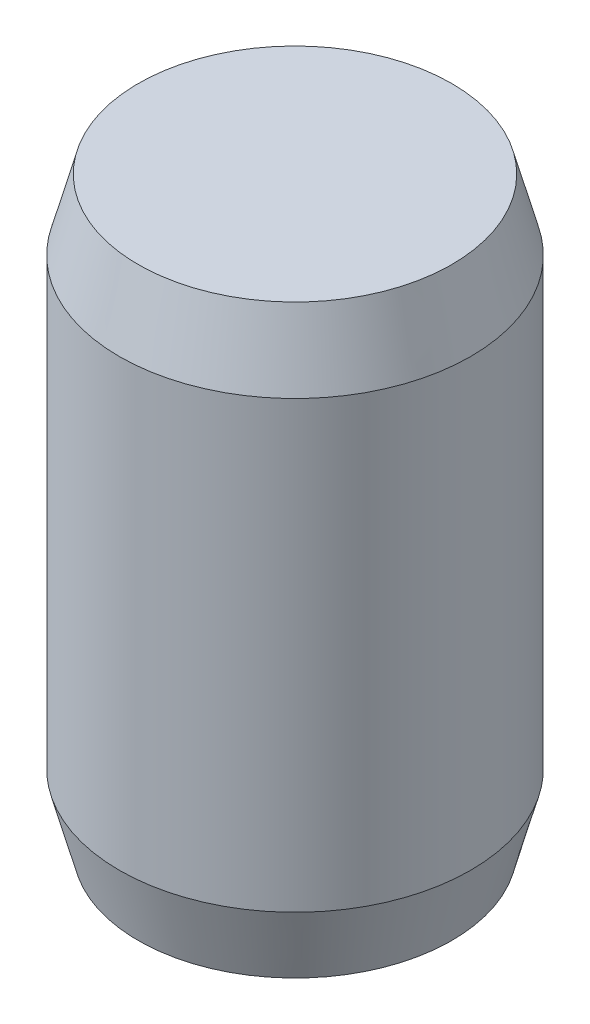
from build123d import *


with BuildPart() as part:
    # Esquisse1 → Base-R_volution (revolve)
    with BuildSketch(Plane.XY, mode=Mode.PRIVATE) as base_r_volution_sk:
        Polygon((3, -8.8), (3, -1.2), (2.678460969, 0), (0, 0), (0, -10), (2.678460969, -10), align=None)
    revolve(base_r_volution_sk.sketch.rotate(Axis((0, 0, 0), (0, 1, 0)), 90), axis=Axis((0, 0, 0), (0, 1, 0)))


solid = part.part
